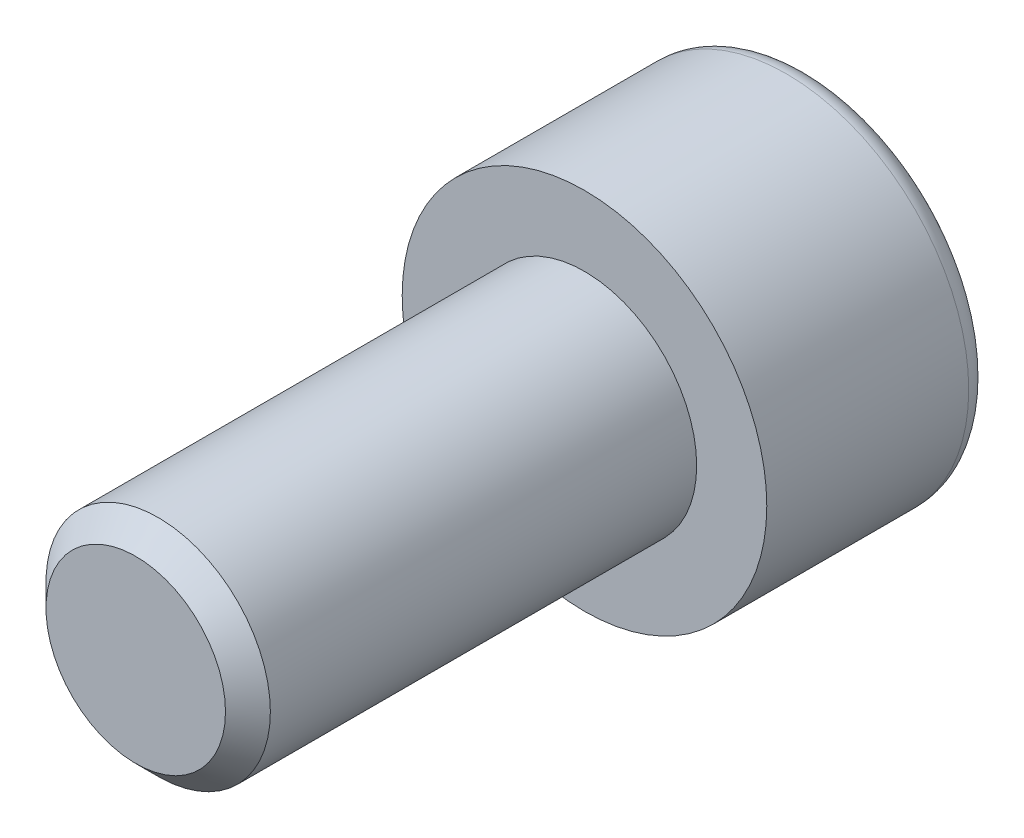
from build123d import *

# Parameters (mm, degrees)
ENLEV_MAT_EXTRU1_DEPTH = 4
ESQUISSE3_W            = 4
ESQUISSE3_H            = 16
CHANFREIN1_SIZE        = 0.8


with BuildPart() as part:
    # Esquisse1 → Base-R_volution (revolve)
    with BuildSketch(Plane(origin=(0, 0, 0), x_dir=(1, 0, 0), z_dir=(0, 1, 0)), mode=Mode.PRIVATE) as base_r_volution_sk:
        with BuildLine():
            Line((0, 0), (6.5, 0))
            Line((6.5, 0), (6.5, 7.2))
            ThreePointArc((6.5, 7.2), (6.265685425, 7.765685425), (5.7, 8))
            Line((5.7, 8), (0, 8))
            Line((0, 8), (0, 0))
        make_face()
    revolve(base_r_volution_sk.sketch.rotate(Axis((0, 0, 0), (0, 0, -1)), 180), axis=Axis((0, 0, 0), (0, 0, -1)))

    # Esquisse2 → enlev-mat-Extru1 (cut)
    with BuildSketch(Plane.XY.offset(-8)):
        Polygon((3, -1.732050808), (3, 1.732050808), (0, 3.464101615), (-3, 1.732050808), (-3, -1.732050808), (0, -3.464101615), align=None)
    extrude(amount=ENLEV_MAT_EXTRU1_DEPTH, mode=Mode.SUBTRACT)

    # Esquisse3 → Boss.-R_vol.1 (revolve)
    with BuildSketch(Plane(origin=(0, 0, 0), x_dir=(1, 0, 0), z_dir=(0, 1, 0))):
        with Locations((2, -8)):
            Rectangle(ESQUISSE3_W, ESQUISSE3_H)
    revolve(axis=Axis((0, 0, 0), (0, 0, 1)))

    # Chanfrein1
    chanfrein1_edges = [part.edges().sort_by_distance(p)[0] for p in [
        (-4, 0, 16),
    ]]
    chamfer(chanfrein1_edges, length=CHANFREIN1_SIZE)


solid = part.part
